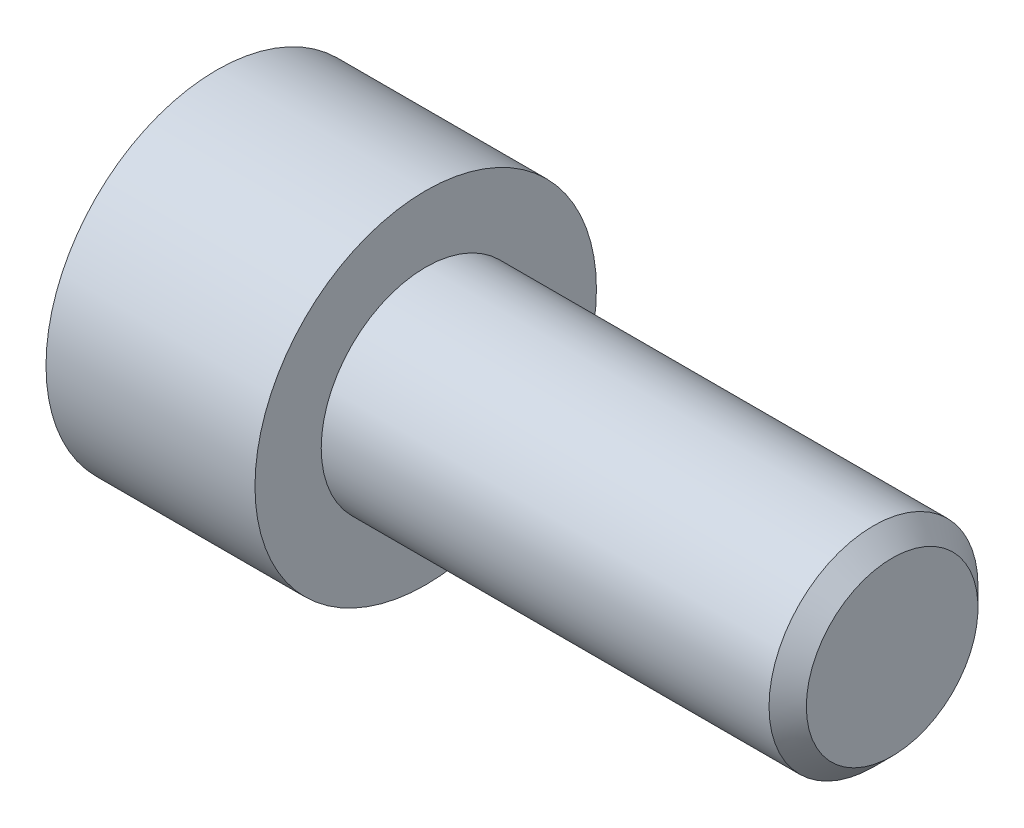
ISO-10303-21;
HEADER;
FILE_DESCRIPTION(('STEP AP214'),'2;1');
FILE_NAME('part.step','',(''),(''),'','','');
FILE_SCHEMA(('AUTOMOTIVE_DESIGN { 1 0 10303 214 1 1 1 1 }'));
ENDSEC;
DATA;
#1=APPLICATION_CONTEXT('core data for automotive mechanical design processes');
#2=APPLICATION_PROTOCOL_DEFINITION('international standard','automotive_design',2000,#1);
#3=PRODUCT_CONTEXT('',#1,'mechanical');
#4=PRODUCT('Part','Part','',(#3));
#5=PRODUCT_RELATED_PRODUCT_CATEGORY('part','',(#4));
#6=PRODUCT_DEFINITION_FORMATION('','',#4);
#7=PRODUCT_DEFINITION_CONTEXT('part definition',#1,'design');
#8=PRODUCT_DEFINITION('design','',#6,#7);
#9=PRODUCT_DEFINITION_SHAPE('','',#8);
#10=(LENGTH_UNIT() NAMED_UNIT(*) SI_UNIT(.MILLI.,.METRE.));
#11=(NAMED_UNIT(*) PLANE_ANGLE_UNIT() SI_UNIT($,.RADIAN.));
#12=(NAMED_UNIT(*) SI_UNIT($,.STERADIAN.) SOLID_ANGLE_UNIT());
#13=UNCERTAINTY_MEASURE_WITH_UNIT(LENGTH_MEASURE(1.E-05),#10,'distance_accuracy_value','');
#14=(GEOMETRIC_REPRESENTATION_CONTEXT(3) GLOBAL_UNCERTAINTY_ASSIGNED_CONTEXT((#13)) GLOBAL_UNIT_ASSIGNED_CONTEXT((#10,
#11,#12)) REPRESENTATION_CONTEXT('',''));
#15=CARTESIAN_POINT('',(0.,0.,0.));
#16=DIRECTION('',(0.,0.,1.));
#17=DIRECTION('',(1.,0.,0.));
#18=AXIS2_PLACEMENT_3D('',#15,#16,#17);
#19=CARTESIAN_POINT('',(0.,-0.687774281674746,1.19126));
#20=DIRECTION('',(0.,0.,1.));
#21=DIRECTION('',(1.,0.,0.));
#22=AXIS2_PLACEMENT_3D('',#19,#20,#21);
#23=PLANE('',#22);
#24=DIRECTION('',(0.,1.,0.));
#25=VECTOR('',#24,1.);
#26=CARTESIAN_POINT('',(2.032,-0.687774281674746,1.19126));
#27=LINE('',#26,#25);
#28=CARTESIAN_POINT('',(2.032,-0.687774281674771,1.19126000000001));
#29=VERTEX_POINT('',#28);
#30=CARTESIAN_POINT('',(2.032,0.687774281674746,1.19126));
#31=VERTEX_POINT('',#30);
#32=EDGE_CURVE('E65',#29,#31,#27,.T.);
#33=ORIENTED_EDGE('',*,*,#32,.F.);
#34=DIRECTION('',(1.,0.,0.));
#35=VECTOR('',#34,1.);
#36=CARTESIAN_POINT('',(0.,-0.687774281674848,1.19126000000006));
#37=LINE('',#36,#35);
#38=CARTESIAN_POINT('',(0.,-0.687774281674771,1.19126000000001));
#39=VERTEX_POINT('',#38);
#40=EDGE_CURVE('E85',#29,#39,#37,.F.);
#41=ORIENTED_EDGE('',*,*,#40,.T.);
#42=DIRECTION('',(0.,1.,0.));
#43=VECTOR('',#42,1.);
#44=CARTESIAN_POINT('',(0.,-0.687774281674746,1.19126));
#45=LINE('',#44,#43);
#46=CARTESIAN_POINT('',(0.,0.687774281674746,1.19126));
#47=VERTEX_POINT('',#46);
#48=EDGE_CURVE('E73',#47,#39,#45,.F.);
#49=ORIENTED_EDGE('',*,*,#48,.F.);
#50=DIRECTION('',(1.,0.,0.));
#51=VECTOR('',#50,1.);
#52=CARTESIAN_POINT('',(0.,0.687774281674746,1.19126));
#53=LINE('',#52,#51);
#54=EDGE_CURVE('E80',#47,#31,#53,.T.);
#55=ORIENTED_EDGE('',*,*,#54,.T.);
#56=EDGE_LOOP('',(#33,#41,#49,#55));
#57=FACE_BOUND('',#56,.T.);
#58=ADVANCED_FACE('F16',(#57),#23,.F.);
#59=CARTESIAN_POINT('',(0.,0.687774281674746,1.19126));
#60=DIRECTION('',(0.,0.866025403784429,0.500000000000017));
#61=DIRECTION('',(0.,-0.500000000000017,0.866025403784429));
#62=AXIS2_PLACEMENT_3D('',#59,#60,#61);
#63=PLANE('',#62);
#64=DIRECTION('',(0.,-0.500000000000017,0.866025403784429));
#65=VECTOR('',#64,1.);
#66=CARTESIAN_POINT('',(2.032,0.687774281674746,1.19126));
#67=LINE('',#66,#65);
#68=CARTESIAN_POINT('',(2.032,1.37554856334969,0.));
#69=VERTEX_POINT('',#68);
#70=EDGE_CURVE('E89',#31,#69,#67,.F.);
#71=ORIENTED_EDGE('',*,*,#70,.F.);
#72=ORIENTED_EDGE('',*,*,#54,.F.);
#73=DIRECTION('',(0.,-0.500000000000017,0.866025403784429));
#74=VECTOR('',#73,1.);
#75=CARTESIAN_POINT('',(0.,0.687774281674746,1.19126));
#76=LINE('',#75,#74);
#77=CARTESIAN_POINT('',(0.,1.37554856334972,0.));
#78=VERTEX_POINT('',#77);
#79=EDGE_CURVE('E69',#78,#47,#76,.T.);
#80=ORIENTED_EDGE('',*,*,#79,.F.);
#81=DIRECTION('',(1.,0.,0.));
#82=VECTOR('',#81,1.);
#83=CARTESIAN_POINT('',(0.,1.37554856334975,0.));
#84=LINE('',#83,#82);
#85=EDGE_CURVE('E128',#78,#69,#84,.T.);
#86=ORIENTED_EDGE('',*,*,#85,.T.);
#87=EDGE_LOOP('',(#71,#72,#80,#86));
#88=FACE_BOUND('',#87,.T.);
#89=ADVANCED_FACE('F88',(#88),#63,.F.);
#90=CARTESIAN_POINT('',(0.,-1.37554856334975,0.));
#91=DIRECTION('',(0.,-0.866025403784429,0.500000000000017));
#92=DIRECTION('',(0.,-0.500000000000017,-0.866025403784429));
#93=AXIS2_PLACEMENT_3D('',#90,#91,#92);
#94=PLANE('',#93);
#95=DIRECTION('',(0.,0.500000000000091,0.866025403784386));
#96=VECTOR('',#95,1.);
#97=CARTESIAN_POINT('',(2.032,-1.37554856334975,0.));
#98=LINE('',#97,#96);
#99=CARTESIAN_POINT('',(2.032,-1.37554856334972,0.));
#100=VERTEX_POINT('',#99);
#101=EDGE_CURVE('E126',#100,#29,#98,.T.);
#102=ORIENTED_EDGE('',*,*,#101,.F.);
#103=DIRECTION('',(1.,0.,0.));
#104=VECTOR('',#103,1.);
#105=CARTESIAN_POINT('',(0.,-1.37554856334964,0.));
#106=LINE('',#105,#104);
#107=CARTESIAN_POINT('',(0.,-1.37554856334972,0.));
#108=VERTEX_POINT('',#107);
#109=EDGE_CURVE('E116',#100,#108,#106,.F.);
#110=ORIENTED_EDGE('',*,*,#109,.T.);
#111=DIRECTION('',(0.,-0.500000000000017,-0.866025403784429));
#112=VECTOR('',#111,1.);
#113=CARTESIAN_POINT('',(0.,-1.37554856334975,0.));
#114=LINE('',#113,#112);
#115=EDGE_CURVE('E91',#39,#108,#114,.T.);
#116=ORIENTED_EDGE('',*,*,#115,.F.);
#117=ORIENTED_EDGE('',*,*,#40,.F.);
#118=EDGE_LOOP('',(#102,#110,#116,#117));
#119=FACE_BOUND('',#118,.T.);
#120=ADVANCED_FACE('F133',(#119),#94,.F.);
#121=CARTESIAN_POINT('',(0.,1.37554856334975,0.));
#122=DIRECTION('',(0.,0.866025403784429,-0.500000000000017));
#123=DIRECTION('',(0.,0.500000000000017,0.866025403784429));
#124=AXIS2_PLACEMENT_3D('',#121,#122,#123);
#125=PLANE('',#124);
#126=DIRECTION('',(0.,-0.500000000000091,-0.866025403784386));
#127=VECTOR('',#126,1.);
#128=CARTESIAN_POINT('',(2.032,1.37554856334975,0.));
#129=LINE('',#128,#127);
#130=CARTESIAN_POINT('',(2.032,0.687774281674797,-1.19126000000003));
#131=VERTEX_POINT('',#130);
#132=EDGE_CURVE('E123',#69,#131,#129,.T.);
#133=ORIENTED_EDGE('',*,*,#132,.F.);
#134=ORIENTED_EDGE('',*,*,#85,.F.);
#135=DIRECTION('',(0.,0.500000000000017,0.866025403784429));
#136=VECTOR('',#135,1.);
#137=CARTESIAN_POINT('',(0.,1.37554856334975,0.));
#138=LINE('',#137,#136);
#139=CARTESIAN_POINT('',(0.,0.687774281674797,-1.19126000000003));
#140=VERTEX_POINT('',#139);
#141=EDGE_CURVE('E75',#140,#78,#138,.T.);
#142=ORIENTED_EDGE('',*,*,#141,.F.);
#143=DIRECTION('',(-1.,0.,0.));
#144=VECTOR('',#143,1.);
#145=CARTESIAN_POINT('',(0.,0.687774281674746,-1.19126));
#146=LINE('',#145,#144);
#147=EDGE_CURVE('E114',#140,#131,#146,.F.);
#148=ORIENTED_EDGE('',*,*,#147,.T.);
#149=EDGE_LOOP('',(#133,#134,#142,#148));
#150=FACE_BOUND('',#149,.T.);
#151=ADVANCED_FACE('F144',(#150),#125,.F.);
#152=CARTESIAN_POINT('',(2.032,3.10811438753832E-13,0.));
#153=DIRECTION('',(-1.,0.,0.));
#154=DIRECTION('',(0.,0.,1.));
#155=AXIS2_PLACEMENT_3D('',#152,#153,#154);
#156=PLANE('',#155);
#157=ORIENTED_EDGE('',*,*,#132,.T.);
#158=DIRECTION('',(0.,1.,0.));
#159=VECTOR('',#158,1.);
#160=CARTESIAN_POINT('',(2.032,0.687774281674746,-1.19126));
#161=LINE('',#160,#159);
#162=CARTESIAN_POINT('',(2.032,-0.687774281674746,-1.19126));
#163=VERTEX_POINT('',#162);
#164=EDGE_CURVE('E109',#131,#163,#161,.F.);
#165=ORIENTED_EDGE('',*,*,#164,.T.);
#166=DIRECTION('',(0.,0.500000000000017,-0.866025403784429));
#167=VECTOR('',#166,1.);
#168=CARTESIAN_POINT('',(2.032,-0.687774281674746,-1.19126));
#169=LINE('',#168,#167);
#170=EDGE_CURVE('E119',#163,#100,#169,.F.);
#171=ORIENTED_EDGE('',*,*,#170,.T.);
#172=ORIENTED_EDGE('',*,*,#101,.T.);
#173=ORIENTED_EDGE('',*,*,#32,.T.);
#174=ORIENTED_EDGE('',*,*,#70,.T.);
#175=EDGE_LOOP('',(#157,#165,#171,#172,#173,#174));
#176=FACE_BOUND('',#175,.T.);
#177=ADVANCED_FACE('F145',(#176),#156,.T.);
#178=CARTESIAN_POINT('',(0.,-0.687774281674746,-1.19126));
#179=DIRECTION('',(0.,-0.866025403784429,-0.500000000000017));
#180=DIRECTION('',(0.,0.500000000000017,-0.866025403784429));
#181=AXIS2_PLACEMENT_3D('',#178,#179,#180);
#182=PLANE('',#181);
#183=ORIENTED_EDGE('',*,*,#170,.F.);
#184=DIRECTION('',(-1.,0.,0.));
#185=VECTOR('',#184,1.);
#186=CARTESIAN_POINT('',(0.,-0.687774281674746,-1.19126));
#187=LINE('',#186,#185);
#188=CARTESIAN_POINT('',(0.,-0.687774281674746,-1.19126));
#189=VERTEX_POINT('',#188);
#190=EDGE_CURVE('E106',#163,#189,#187,.T.);
#191=ORIENTED_EDGE('',*,*,#190,.T.);
#192=DIRECTION('',(0.,0.500000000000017,-0.866025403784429));
#193=VECTOR('',#192,1.);
#194=CARTESIAN_POINT('',(0.,-0.687774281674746,-1.19126));
#195=LINE('',#194,#193);
#196=EDGE_CURVE('E34',#108,#189,#195,.T.);
#197=ORIENTED_EDGE('',*,*,#196,.F.);
#198=ORIENTED_EDGE('',*,*,#109,.F.);
#199=EDGE_LOOP('',(#183,#191,#197,#198));
#200=FACE_BOUND('',#199,.T.);
#201=ADVANCED_FACE('F136',(#200),#182,.F.);
#202=CARTESIAN_POINT('',(0.,0.687774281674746,-1.19126));
#203=DIRECTION('',(0.,0.,-1.));
#204=DIRECTION('',(-1.,0.,0.));
#205=AXIS2_PLACEMENT_3D('',#202,#203,#204);
#206=PLANE('',#205);
#207=ORIENTED_EDGE('',*,*,#164,.F.);
#208=ORIENTED_EDGE('',*,*,#147,.F.);
#209=DIRECTION('',(0.,1.,0.));
#210=VECTOR('',#209,1.);
#211=CARTESIAN_POINT('',(0.,3.11060286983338E-13,-1.19126));
#212=LINE('',#211,#210);
#213=EDGE_CURVE('E103',#189,#140,#212,.T.);
#214=ORIENTED_EDGE('',*,*,#213,.F.);
#215=ORIENTED_EDGE('',*,*,#190,.F.);
#216=EDGE_LOOP('',(#207,#208,#214,#215));
#217=FACE_BOUND('',#216,.T.);
#218=ADVANCED_FACE('F141',(#217),#206,.F.);
#219=CARTESIAN_POINT('',(0.,3.11060286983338E-13,0.));
#220=DIRECTION('',(-1.,0.,0.));
#221=DIRECTION('',(0.,0.,1.));
#222=AXIS2_PLACEMENT_3D('',#219,#220,#221);
#223=PLANE('',#222);
#224=ORIENTED_EDGE('',*,*,#196,.T.);
#225=ORIENTED_EDGE('',*,*,#213,.T.);
#226=ORIENTED_EDGE('',*,*,#141,.T.);
#227=ORIENTED_EDGE('',*,*,#79,.T.);
#228=ORIENTED_EDGE('',*,*,#48,.T.);
#229=ORIENTED_EDGE('',*,*,#115,.T.);
#230=EDGE_LOOP('',(#224,#225,#226,#227,#228,#229));
#231=FACE_BOUND('',#230,.T.);
#232=CARTESIAN_POINT('',(0.,3.09877946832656E-13,0.));
#233=DIRECTION('',(-1.,0.,0.));
#234=DIRECTION('',(0.,0.,1.));
#235=AXIS2_PLACEMENT_3D('',#232,#233,#234);
#236=CIRCLE('',#235,2.3241);
#237=CARTESIAN_POINT('',(0.,3.09877946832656E-13,2.3241));
#238=VERTEX_POINT('',#237);
#239=EDGE_CURVE('E19',#238,#238,#236,.F.);
#240=ORIENTED_EDGE('',*,*,#239,.F.);
#241=EDGE_LOOP('',(#240));
#242=FACE_BOUND('',#241,.T.);
#243=ADVANCED_FACE('F71',(#231,#242),#223,.T.);
#244=CARTESIAN_POINT('',(9.1948,3.09934248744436E-13,0.));
#245=DIRECTION('',(-1.,0.,0.));
#246=DIRECTION('',(0.,0.,1.));
#247=AXIS2_PLACEMENT_3D('',#244,#245,#246);
#248=PLANE('',#247);
#249=CARTESIAN_POINT('',(9.19479999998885,3.09973401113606E-13,0.));
#250=DIRECTION('',(-1.,0.,0.));
#251=DIRECTION('',(0.,0.,1.));
#252=AXIS2_PLACEMENT_3D('',#249,#250,#251);
#253=CIRCLE('',#252,1.16840000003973);
#254=CARTESIAN_POINT('',(9.19479999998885,3.09973401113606E-13,1.16840000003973));
#255=VERTEX_POINT('',#254);
#256=EDGE_CURVE('E98',#255,#255,#253,.T.);
#257=ORIENTED_EDGE('',*,*,#256,.F.);
#258=EDGE_LOOP('',(#257));
#259=FACE_BOUND('',#258,.T.);
#260=ADVANCED_FACE('F174',(#259),#248,.F.);
#261=CARTESIAN_POINT('',(9.65454,3.09877946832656E-13,0.));
#262=DIRECTION('',(-1.,0.,0.));
#263=DIRECTION('',(0.,0.,1.));
#264=AXIS2_PLACEMENT_3D('',#261,#262,#263);
#265=CYLINDRICAL_SURFACE('',#264,2.3241);
#266=CARTESIAN_POINT('',(2.8448,3.09877946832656E-13,0.));
#267=DIRECTION('',(-1.,0.,0.));
#268=DIRECTION('',(0.,0.,1.));
#269=AXIS2_PLACEMENT_3D('',#266,#267,#268);
#270=CIRCLE('',#269,2.3241);
#271=CARTESIAN_POINT('',(2.8448,3.09877946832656E-13,2.3241));
#272=VERTEX_POINT('',#271);
#273=EDGE_CURVE('E96',#272,#272,#270,.T.);
#274=ORIENTED_EDGE('',*,*,#273,.T.);
#275=EDGE_LOOP('',(#274));
#276=FACE_BOUND('',#275,.T.);
#277=ORIENTED_EDGE('',*,*,#239,.T.);
#278=EDGE_LOOP('',(#277));
#279=FACE_BOUND('',#278,.T.);
#280=ADVANCED_FACE('F170',(#276,#279),#265,.T.);
#281=CARTESIAN_POINT('',(8.94080000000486,3.09973401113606E-13,0.));
#282=DIRECTION('',(-1.,0.,0.));
#283=DIRECTION('',(0.,0.,1.));
#284=AXIS2_PLACEMENT_3D('',#281,#282,#283);
#285=CONICAL_SURFACE('',#284,1.42240000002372,0.785398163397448);
#286=CARTESIAN_POINT('',(8.9408,3.09877946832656E-13,0.));
#287=DIRECTION('',(-1.,0.,0.));
#288=DIRECTION('',(0.,0.,1.));
#289=AXIS2_PLACEMENT_3D('',#286,#287,#288);
#290=CIRCLE('',#289,1.4224);
#291=CARTESIAN_POINT('',(8.9408,3.09877946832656E-13,1.4224));
#292=VERTEX_POINT('',#291);
#293=EDGE_CURVE('E25',#292,#292,#290,.T.);
#294=ORIENTED_EDGE('',*,*,#293,.F.);
#295=EDGE_LOOP('',(#294));
#296=FACE_BOUND('',#295,.T.);
#297=ORIENTED_EDGE('',*,*,#256,.T.);
#298=EDGE_LOOP('',(#297));
#299=FACE_BOUND('',#298,.T.);
#300=ADVANCED_FACE('F163',(#296,#299),#285,.T.);
#301=CARTESIAN_POINT('',(2.8448,3.10711899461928E-13,0.));
#302=DIRECTION('',(-1.,0.,0.));
#303=DIRECTION('',(0.,0.,1.));
#304=AXIS2_PLACEMENT_3D('',#301,#302,#303);
#305=PLANE('',#304);
#306=CARTESIAN_POINT('',(2.8448,3.09877946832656E-13,0.));
#307=DIRECTION('',(-1.,0.,0.));
#308=DIRECTION('',(0.,0.,1.));
#309=AXIS2_PLACEMENT_3D('',#306,#307,#308);
#310=CIRCLE('',#309,1.4224);
#311=CARTESIAN_POINT('',(2.8448,3.09877946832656E-13,1.4224));
#312=VERTEX_POINT('',#311);
#313=EDGE_CURVE('E11',#312,#312,#310,.F.);
#314=ORIENTED_EDGE('',*,*,#313,.F.);
#315=EDGE_LOOP('',(#314));
#316=FACE_BOUND('',#315,.T.);
#317=ORIENTED_EDGE('',*,*,#273,.F.);
#318=EDGE_LOOP('',(#317));
#319=FACE_BOUND('',#318,.T.);
#320=ADVANCED_FACE('F157',(#316,#319),#305,.F.);
#321=CARTESIAN_POINT('',(9.65454,3.09877946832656E-13,0.));
#322=DIRECTION('',(-1.,0.,0.));
#323=DIRECTION('',(0.,0.,1.));
#324=AXIS2_PLACEMENT_3D('',#321,#322,#323);
#325=CYLINDRICAL_SURFACE('',#324,1.4224);
#326=ORIENTED_EDGE('',*,*,#313,.T.);
#327=EDGE_LOOP('',(#326));
#328=FACE_BOUND('',#327,.T.);
#329=ORIENTED_EDGE('',*,*,#293,.T.);
#330=EDGE_LOOP('',(#329));
#331=FACE_BOUND('',#330,.T.);
#332=ADVANCED_FACE('F155',(#328,#331),#325,.T.);
#333=CLOSED_SHELL('',(#58,#89,#120,#151,#177,#201,#218,#243,#260,#280,#300,#320,#332));
#334=MANIFOLD_SOLID_BREP('B1',#333);
#335=ADVANCED_BREP_SHAPE_REPRESENTATION('',(#18,#334),#14);
#336=SHAPE_DEFINITION_REPRESENTATION(#9,#335);
ENDSEC;
END-ISO-10303-21;
